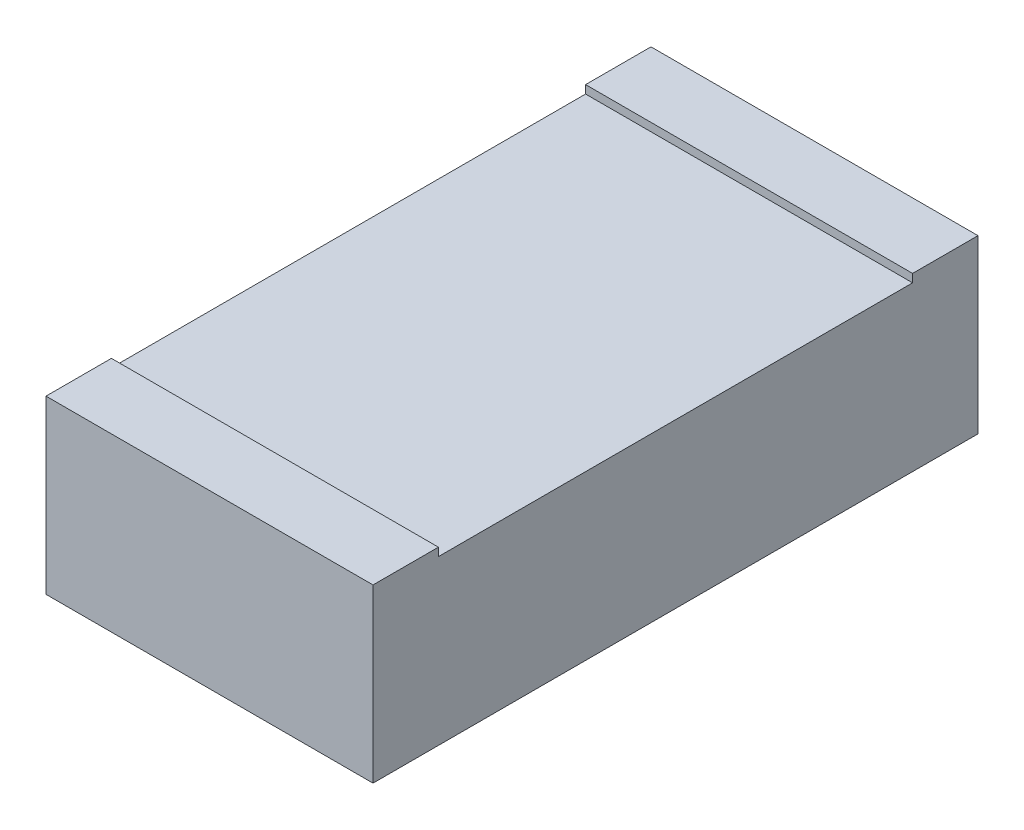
ISO-10303-21;
HEADER;
FILE_DESCRIPTION(('STEP AP214'),'2;1');
FILE_NAME('part.step','',(''),(''),'','','');
FILE_SCHEMA(('AUTOMOTIVE_DESIGN { 1 0 10303 214 1 1 1 1 }'));
ENDSEC;
DATA;
#1=APPLICATION_CONTEXT('core data for automotive mechanical design processes');
#2=APPLICATION_PROTOCOL_DEFINITION('international standard','automotive_design',2000,#1);
#3=PRODUCT_CONTEXT('',#1,'mechanical');
#4=PRODUCT('Part','Part','',(#3));
#5=PRODUCT_RELATED_PRODUCT_CATEGORY('part','',(#4));
#6=PRODUCT_DEFINITION_FORMATION('','',#4);
#7=PRODUCT_DEFINITION_CONTEXT('part definition',#1,'design');
#8=PRODUCT_DEFINITION('design','',#6,#7);
#9=PRODUCT_DEFINITION_SHAPE('','',#8);
#10=(LENGTH_UNIT() NAMED_UNIT(*) SI_UNIT(.MILLI.,.METRE.));
#11=(NAMED_UNIT(*) PLANE_ANGLE_UNIT() SI_UNIT($,.RADIAN.));
#12=(NAMED_UNIT(*) SI_UNIT($,.STERADIAN.) SOLID_ANGLE_UNIT());
#13=UNCERTAINTY_MEASURE_WITH_UNIT(LENGTH_MEASURE(1.E-05),#10,'distance_accuracy_value','');
#14=(GEOMETRIC_REPRESENTATION_CONTEXT(3) GLOBAL_UNCERTAINTY_ASSIGNED_CONTEXT((#13)) GLOBAL_UNIT_ASSIGNED_CONTEXT((#10,
#11,#12)) REPRESENTATION_CONTEXT('',''));
#15=CARTESIAN_POINT('',(0.,0.,0.));
#16=DIRECTION('',(0.,0.,1.));
#17=DIRECTION('',(1.,0.,0.));
#18=AXIS2_PLACEMENT_3D('',#15,#16,#17);
#19=CARTESIAN_POINT('',(0.,0.5,0.));
#20=DIRECTION('',(0.,1.,0.));
#21=DIRECTION('',(0.,0.,1.));
#22=AXIS2_PLACEMENT_3D('',#19,#20,#21);
#23=PLANE('',#22);
#24=DIRECTION('',(0.,0.,1.));
#25=VECTOR('',#24,1.);
#26=CARTESIAN_POINT('',(-0.5,0.5,0.925));
#27=LINE('',#26,#25);
#28=CARTESIAN_POINT('',(-0.5,0.5,-0.725));
#29=VERTEX_POINT('',#28);
#30=CARTESIAN_POINT('',(-0.5,0.5,0.725));
#31=VERTEX_POINT('',#30);
#32=EDGE_CURVE('E52',#29,#31,#27,.T.);
#33=ORIENTED_EDGE('',*,*,#32,.T.);
#34=DIRECTION('',(-1.,0.,0.));
#35=VECTOR('',#34,1.);
#36=CARTESIAN_POINT('',(-0.5,0.5,0.725));
#37=LINE('',#36,#35);
#38=CARTESIAN_POINT('',(0.5,0.5,0.725));
#39=VERTEX_POINT('',#38);
#40=EDGE_CURVE('E47',#39,#31,#37,.T.);
#41=ORIENTED_EDGE('',*,*,#40,.F.);
#42=DIRECTION('',(0.,0.,-1.));
#43=VECTOR('',#42,1.);
#44=CARTESIAN_POINT('',(0.5,0.5,0.925));
#45=LINE('',#44,#43);
#46=CARTESIAN_POINT('',(0.5,0.5,-0.725));
#47=VERTEX_POINT('',#46);
#48=EDGE_CURVE('E147',#39,#47,#45,.T.);
#49=ORIENTED_EDGE('',*,*,#48,.T.);
#50=DIRECTION('',(1.,0.,0.));
#51=VECTOR('',#50,1.);
#52=CARTESIAN_POINT('',(-0.5,0.5,-0.725));
#53=LINE('',#52,#51);
#54=EDGE_CURVE('E125',#29,#47,#53,.T.);
#55=ORIENTED_EDGE('',*,*,#54,.F.);
#56=EDGE_LOOP('',(#33,#41,#49,#55));
#57=FACE_BOUND('',#56,.T.);
#58=ADVANCED_FACE('F32',(#57),#23,.T.);
#59=CARTESIAN_POINT('',(-0.5,0.5,0.925));
#60=DIRECTION('',(1.,0.,0.));
#61=DIRECTION('',(0.,0.,-1.));
#62=AXIS2_PLACEMENT_3D('',#59,#60,#61);
#63=PLANE('',#62);
#64=DIRECTION('',(0.,0.,1.));
#65=VECTOR('',#64,1.);
#66=CARTESIAN_POINT('',(-0.5,0.,0.925));
#67=LINE('',#66,#65);
#68=CARTESIAN_POINT('',(-0.5,0.,-0.925));
#69=VERTEX_POINT('',#68);
#70=CARTESIAN_POINT('',(-0.5,0.,0.925));
#71=VERTEX_POINT('',#70);
#72=EDGE_CURVE('E145',#69,#71,#67,.T.);
#73=ORIENTED_EDGE('',*,*,#72,.T.);
#74=DIRECTION('',(0.,-1.,0.));
#75=VECTOR('',#74,1.);
#76=CARTESIAN_POINT('',(-0.5,0.5,0.925));
#77=LINE('',#76,#75);
#78=CARTESIAN_POINT('',(-0.5,0.525,0.925));
#79=VERTEX_POINT('',#78);
#80=EDGE_CURVE('E11',#79,#71,#77,.T.);
#81=ORIENTED_EDGE('',*,*,#80,.F.);
#82=DIRECTION('',(0.,0.,1.));
#83=VECTOR('',#82,1.);
#84=CARTESIAN_POINT('',(-0.5,0.525,0.925));
#85=LINE('',#84,#83);
#86=CARTESIAN_POINT('',(-0.5,0.525,0.725));
#87=VERTEX_POINT('',#86);
#88=EDGE_CURVE('E115',#87,#79,#85,.T.);
#89=ORIENTED_EDGE('',*,*,#88,.F.);
#90=DIRECTION('',(0.,-1.,0.));
#91=VECTOR('',#90,1.);
#92=CARTESIAN_POINT('',(-0.5,0.525,0.725));
#93=LINE('',#92,#91);
#94=EDGE_CURVE('E120',#87,#31,#93,.T.);
#95=ORIENTED_EDGE('',*,*,#94,.T.);
#96=ORIENTED_EDGE('',*,*,#32,.F.);
#97=DIRECTION('',(0.,-1.,0.));
#98=VECTOR('',#97,1.);
#99=CARTESIAN_POINT('',(-0.5,0.525,-0.725));
#100=LINE('',#99,#98);
#101=CARTESIAN_POINT('',(-0.5,0.525,-0.725));
#102=VERTEX_POINT('',#101);
#103=EDGE_CURVE('E142',#102,#29,#100,.T.);
#104=ORIENTED_EDGE('',*,*,#103,.F.);
#105=DIRECTION('',(0.,0.,1.));
#106=VECTOR('',#105,1.);
#107=CARTESIAN_POINT('',(-0.5,0.525,-0.925));
#108=LINE('',#107,#106);
#109=CARTESIAN_POINT('',(-0.5,0.525,-0.925));
#110=VERTEX_POINT('',#109);
#111=EDGE_CURVE('E126',#110,#102,#108,.T.);
#112=ORIENTED_EDGE('',*,*,#111,.F.);
#113=DIRECTION('',(0.,-1.,0.));
#114=VECTOR('',#113,1.);
#115=CARTESIAN_POINT('',(-0.5,0.5,-0.925));
#116=LINE('',#115,#114);
#117=EDGE_CURVE('E150',#110,#69,#116,.T.);
#118=ORIENTED_EDGE('',*,*,#117,.T.);
#119=EDGE_LOOP('',(#73,#81,#89,#95,#96,#104,#112,#118));
#120=FACE_BOUND('',#119,.T.);
#121=ADVANCED_FACE('F34',(#120),#63,.F.);
#122=CARTESIAN_POINT('',(0.5,0.5,0.925));
#123=DIRECTION('',(0.,0.,-1.));
#124=DIRECTION('',(-1.,0.,0.));
#125=AXIS2_PLACEMENT_3D('',#122,#123,#124);
#126=PLANE('',#125);
#127=DIRECTION('',(1.,0.,0.));
#128=VECTOR('',#127,1.);
#129=CARTESIAN_POINT('',(0.5,0.,0.925));
#130=LINE('',#129,#128);
#131=CARTESIAN_POINT('',(0.5,0.,0.925));
#132=VERTEX_POINT('',#131);
#133=EDGE_CURVE('E99',#71,#132,#130,.T.);
#134=ORIENTED_EDGE('',*,*,#133,.T.);
#135=DIRECTION('',(0.,-1.,0.));
#136=VECTOR('',#135,1.);
#137=CARTESIAN_POINT('',(0.5,0.5,0.925));
#138=LINE('',#137,#136);
#139=CARTESIAN_POINT('',(0.5,0.525,0.925));
#140=VERTEX_POINT('',#139);
#141=EDGE_CURVE('E40',#140,#132,#138,.T.);
#142=ORIENTED_EDGE('',*,*,#141,.F.);
#143=DIRECTION('',(1.,0.,0.));
#144=VECTOR('',#143,1.);
#145=CARTESIAN_POINT('',(-0.5,0.525,0.925));
#146=LINE('',#145,#144);
#147=EDGE_CURVE('E98',#79,#140,#146,.T.);
#148=ORIENTED_EDGE('',*,*,#147,.F.);
#149=ORIENTED_EDGE('',*,*,#80,.T.);
#150=EDGE_LOOP('',(#134,#142,#148,#149));
#151=FACE_BOUND('',#150,.T.);
#152=ADVANCED_FACE('F96',(#151),#126,.F.);
#153=CARTESIAN_POINT('',(0.5,0.5,0.925));
#154=DIRECTION('',(-1.,0.,0.));
#155=DIRECTION('',(0.,0.,1.));
#156=AXIS2_PLACEMENT_3D('',#153,#154,#155);
#157=PLANE('',#156);
#158=DIRECTION('',(0.,0.,-1.));
#159=VECTOR('',#158,1.);
#160=CARTESIAN_POINT('',(0.5,0.,0.925));
#161=LINE('',#160,#159);
#162=CARTESIAN_POINT('',(0.5,0.,-0.925));
#163=VERTEX_POINT('',#162);
#164=EDGE_CURVE('E154',#132,#163,#161,.T.);
#165=ORIENTED_EDGE('',*,*,#164,.T.);
#166=DIRECTION('',(0.,-1.,0.));
#167=VECTOR('',#166,1.);
#168=CARTESIAN_POINT('',(0.5,0.5,-0.925));
#169=LINE('',#168,#167);
#170=CARTESIAN_POINT('',(0.5,0.525,-0.925));
#171=VERTEX_POINT('',#170);
#172=EDGE_CURVE('E102',#171,#163,#169,.T.);
#173=ORIENTED_EDGE('',*,*,#172,.F.);
#174=DIRECTION('',(0.,0.,-1.));
#175=VECTOR('',#174,1.);
#176=CARTESIAN_POINT('',(0.5,0.525,-0.925));
#177=LINE('',#176,#175);
#178=CARTESIAN_POINT('',(0.5,0.525,-0.725));
#179=VERTEX_POINT('',#178);
#180=EDGE_CURVE('E131',#179,#171,#177,.T.);
#181=ORIENTED_EDGE('',*,*,#180,.F.);
#182=DIRECTION('',(0.,-1.,0.));
#183=VECTOR('',#182,1.);
#184=CARTESIAN_POINT('',(0.5,0.525,-0.725));
#185=LINE('',#184,#183);
#186=EDGE_CURVE('E137',#179,#47,#185,.T.);
#187=ORIENTED_EDGE('',*,*,#186,.T.);
#188=ORIENTED_EDGE('',*,*,#48,.F.);
#189=DIRECTION('',(0.,-1.,0.));
#190=VECTOR('',#189,1.);
#191=CARTESIAN_POINT('',(0.5,0.525,0.725));
#192=LINE('',#191,#190);
#193=CARTESIAN_POINT('',(0.5,0.525,0.725));
#194=VERTEX_POINT('',#193);
#195=EDGE_CURVE('E107',#194,#39,#192,.T.);
#196=ORIENTED_EDGE('',*,*,#195,.F.);
#197=DIRECTION('',(0.,0.,-1.));
#198=VECTOR('',#197,1.);
#199=CARTESIAN_POINT('',(0.5,0.525,0.925));
#200=LINE('',#199,#198);
#201=EDGE_CURVE('E104',#140,#194,#200,.T.);
#202=ORIENTED_EDGE('',*,*,#201,.F.);
#203=ORIENTED_EDGE('',*,*,#141,.T.);
#204=EDGE_LOOP('',(#165,#173,#181,#187,#188,#196,#202,#203));
#205=FACE_BOUND('',#204,.T.);
#206=ADVANCED_FACE('F105',(#205),#157,.F.);
#207=CARTESIAN_POINT('',(0.5,0.5,-0.925));
#208=DIRECTION('',(0.,0.,1.));
#209=DIRECTION('',(1.,0.,0.));
#210=AXIS2_PLACEMENT_3D('',#207,#208,#209);
#211=PLANE('',#210);
#212=DIRECTION('',(-1.,0.,0.));
#213=VECTOR('',#212,1.);
#214=CARTESIAN_POINT('',(0.5,0.,-0.925));
#215=LINE('',#214,#213);
#216=EDGE_CURVE('E148',#163,#69,#215,.T.);
#217=ORIENTED_EDGE('',*,*,#216,.T.);
#218=ORIENTED_EDGE('',*,*,#117,.F.);
#219=DIRECTION('',(-1.,0.,0.));
#220=VECTOR('',#219,1.);
#221=CARTESIAN_POINT('',(-0.5,0.525,-0.925));
#222=LINE('',#221,#220);
#223=EDGE_CURVE('E134',#171,#110,#222,.T.);
#224=ORIENTED_EDGE('',*,*,#223,.F.);
#225=ORIENTED_EDGE('',*,*,#172,.T.);
#226=EDGE_LOOP('',(#217,#218,#224,#225));
#227=FACE_BOUND('',#226,.T.);
#228=ADVANCED_FACE('F163',(#227),#211,.F.);
#229=CARTESIAN_POINT('',(0.,0.,0.));
#230=DIRECTION('',(0.,1.,0.));
#231=DIRECTION('',(0.,0.,1.));
#232=AXIS2_PLACEMENT_3D('',#229,#230,#231);
#233=PLANE('',#232);
#234=ORIENTED_EDGE('',*,*,#72,.F.);
#235=ORIENTED_EDGE('',*,*,#216,.F.);
#236=ORIENTED_EDGE('',*,*,#164,.F.);
#237=ORIENTED_EDGE('',*,*,#133,.F.);
#238=EDGE_LOOP('',(#234,#235,#236,#237));
#239=FACE_BOUND('',#238,.T.);
#240=ADVANCED_FACE('F167',(#239),#233,.F.);
#241=CARTESIAN_POINT('',(-0.5,0.525,-0.725));
#242=DIRECTION('',(0.,0.,-1.));
#243=DIRECTION('',(-1.,0.,0.));
#244=AXIS2_PLACEMENT_3D('',#241,#242,#243);
#245=PLANE('',#244);
#246=ORIENTED_EDGE('',*,*,#54,.T.);
#247=ORIENTED_EDGE('',*,*,#186,.F.);
#248=DIRECTION('',(1.,0.,0.));
#249=VECTOR('',#248,1.);
#250=CARTESIAN_POINT('',(-0.5,0.525,-0.725));
#251=LINE('',#250,#249);
#252=EDGE_CURVE('E129',#102,#179,#251,.T.);
#253=ORIENTED_EDGE('',*,*,#252,.F.);
#254=ORIENTED_EDGE('',*,*,#103,.T.);
#255=EDGE_LOOP('',(#246,#247,#253,#254));
#256=FACE_BOUND('',#255,.T.);
#257=ADVANCED_FACE('F175',(#256),#245,.F.);
#258=CARTESIAN_POINT('',(0.,0.525,0.));
#259=DIRECTION('',(0.,1.,0.));
#260=DIRECTION('',(0.,0.,1.));
#261=AXIS2_PLACEMENT_3D('',#258,#259,#260);
#262=PLANE('',#261);
#263=ORIENTED_EDGE('',*,*,#111,.T.);
#264=ORIENTED_EDGE('',*,*,#252,.T.);
#265=ORIENTED_EDGE('',*,*,#180,.T.);
#266=ORIENTED_EDGE('',*,*,#223,.T.);
#267=EDGE_LOOP('',(#263,#264,#265,#266));
#268=FACE_BOUND('',#267,.T.);
#269=ADVANCED_FACE('F172',(#268),#262,.T.);
#270=CARTESIAN_POINT('',(-0.5,0.525,0.725));
#271=DIRECTION('',(0.,0.,1.));
#272=DIRECTION('',(1.,0.,0.));
#273=AXIS2_PLACEMENT_3D('',#270,#271,#272);
#274=PLANE('',#273);
#275=ORIENTED_EDGE('',*,*,#40,.T.);
#276=ORIENTED_EDGE('',*,*,#94,.F.);
#277=DIRECTION('',(-1.,0.,0.));
#278=VECTOR('',#277,1.);
#279=CARTESIAN_POINT('',(-0.5,0.525,0.725));
#280=LINE('',#279,#278);
#281=EDGE_CURVE('E110',#194,#87,#280,.T.);
#282=ORIENTED_EDGE('',*,*,#281,.F.);
#283=ORIENTED_EDGE('',*,*,#195,.T.);
#284=EDGE_LOOP('',(#275,#276,#282,#283));
#285=FACE_BOUND('',#284,.T.);
#286=ADVANCED_FACE('F178',(#285),#274,.F.);
#287=CARTESIAN_POINT('',(0.,0.525,0.));
#288=DIRECTION('',(0.,1.,0.));
#289=DIRECTION('',(0.,0.,1.));
#290=AXIS2_PLACEMENT_3D('',#287,#288,#289);
#291=PLANE('',#290);
#292=ORIENTED_EDGE('',*,*,#147,.T.);
#293=ORIENTED_EDGE('',*,*,#201,.T.);
#294=ORIENTED_EDGE('',*,*,#281,.T.);
#295=ORIENTED_EDGE('',*,*,#88,.T.);
#296=EDGE_LOOP('',(#292,#293,#294,#295));
#297=FACE_BOUND('',#296,.T.);
#298=ADVANCED_FACE('F113',(#297),#291,.T.);
#299=CLOSED_SHELL('',(#58,#121,#152,#206,#228,#240,#257,#269,#286,#298));
#300=MANIFOLD_SOLID_BREP('B2',#299);
#301=ADVANCED_BREP_SHAPE_REPRESENTATION('',(#18,#300),#14);
#302=SHAPE_DEFINITION_REPRESENTATION(#9,#301);
ENDSEC;
END-ISO-10303-21;
